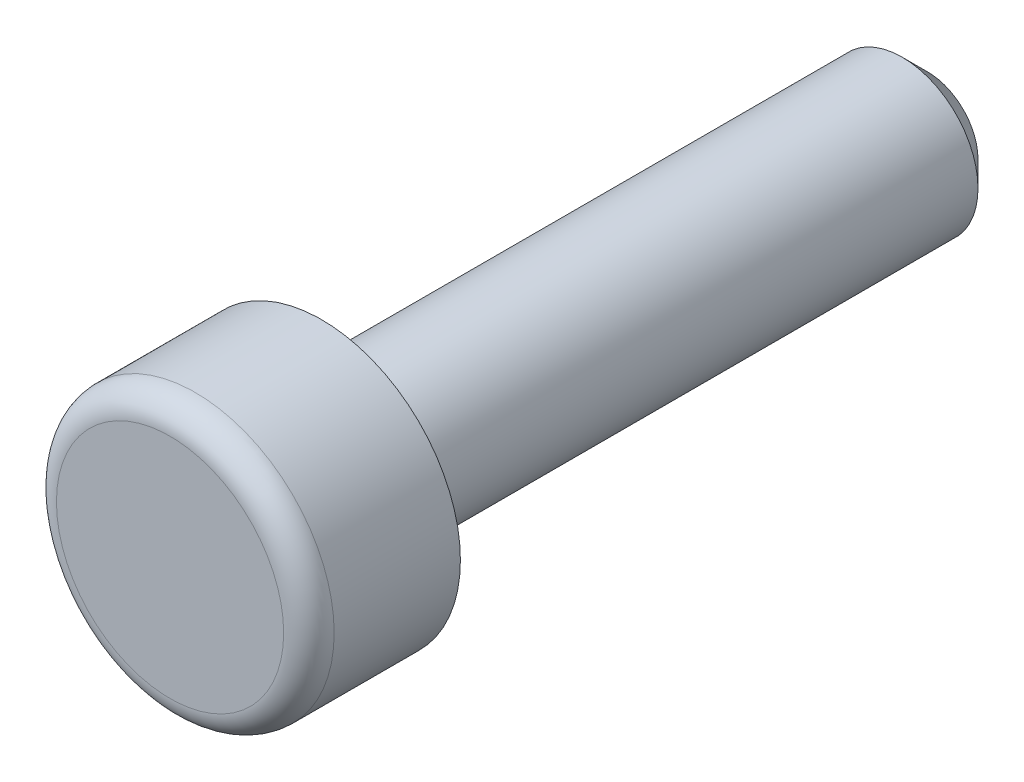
ISO-10303-21;
HEADER;
FILE_DESCRIPTION(('STEP AP214'),'2;1');
FILE_NAME('part.step','',(''),(''),'','','');
FILE_SCHEMA(('AUTOMOTIVE_DESIGN { 1 0 10303 214 1 1 1 1 }'));
ENDSEC;
DATA;
#1=APPLICATION_CONTEXT('core data for automotive mechanical design processes');
#2=APPLICATION_PROTOCOL_DEFINITION('international standard','automotive_design',2000,#1);
#3=PRODUCT_CONTEXT('',#1,'mechanical');
#4=PRODUCT('Part','Part','',(#3));
#5=PRODUCT_RELATED_PRODUCT_CATEGORY('part','',(#4));
#6=PRODUCT_DEFINITION_FORMATION('','',#4);
#7=PRODUCT_DEFINITION_CONTEXT('part definition',#1,'design');
#8=PRODUCT_DEFINITION('design','',#6,#7);
#9=PRODUCT_DEFINITION_SHAPE('','',#8);
#10=(LENGTH_UNIT() NAMED_UNIT(*) SI_UNIT(.MILLI.,.METRE.));
#11=(NAMED_UNIT(*) PLANE_ANGLE_UNIT() SI_UNIT($,.RADIAN.));
#12=(NAMED_UNIT(*) SI_UNIT($,.STERADIAN.) SOLID_ANGLE_UNIT());
#13=UNCERTAINTY_MEASURE_WITH_UNIT(LENGTH_MEASURE(1.E-05),#10,'distance_accuracy_value','');
#14=(GEOMETRIC_REPRESENTATION_CONTEXT(3) GLOBAL_UNCERTAINTY_ASSIGNED_CONTEXT((#13)) GLOBAL_UNIT_ASSIGNED_CONTEXT((#10,
#11,#12)) REPRESENTATION_CONTEXT('',''));
#15=CARTESIAN_POINT('',(0.,0.,0.));
#16=DIRECTION('',(0.,0.,1.));
#17=DIRECTION('',(1.,0.,0.));
#18=AXIS2_PLACEMENT_3D('',#15,#16,#17);
#19=CARTESIAN_POINT('',(0.,0.,3.));
#20=DIRECTION('',(0.,0.,1.));
#21=DIRECTION('',(1.,0.,0.));
#22=AXIS2_PLACEMENT_3D('',#19,#20,#21);
#23=PLANE('',#22);
#24=CARTESIAN_POINT('',(0.,0.,3.));
#25=DIRECTION('',(0.,0.,-1.));
#26=DIRECTION('',(1.,0.,0.));
#27=AXIS2_PLACEMENT_3D('',#24,#25,#26);
#28=CIRCLE('',#27,2.25);
#29=CARTESIAN_POINT('',(2.25,0.,3.));
#30=VERTEX_POINT('',#29);
#31=CARTESIAN_POINT('',(-2.25,0.,3.));
#32=VERTEX_POINT('',#31);
#33=EDGE_CURVE('E37',#30,#32,#28,.T.);
#34=ORIENTED_EDGE('',*,*,#33,.F.);
#35=CARTESIAN_POINT('',(0.,0.,3.));
#36=DIRECTION('',(0.,0.,-1.));
#37=DIRECTION('',(-1.,0.,0.));
#38=AXIS2_PLACEMENT_3D('',#35,#36,#37);
#39=CIRCLE('',#38,2.25);
#40=EDGE_CURVE('E33',#32,#30,#39,.T.);
#41=ORIENTED_EDGE('',*,*,#40,.F.);
#42=EDGE_LOOP('',(#34,#41));
#43=FACE_BOUND('',#42,.T.);
#44=ADVANCED_FACE('F16',(#43),#23,.T.);
#45=CARTESIAN_POINT('',(0.,0.,2.5));
#46=DIRECTION('',(0.,0.,1.));
#47=DIRECTION('',(1.,0.,0.));
#48=AXIS2_PLACEMENT_3D('',#45,#46,#47);
#49=TOROIDAL_SURFACE('',#48,2.25,0.5);
#50=CARTESIAN_POINT('',(0.,0.,2.5));
#51=DIRECTION('',(0.,0.,1.));
#52=DIRECTION('',(1.,0.,0.));
#53=AXIS2_PLACEMENT_3D('',#50,#51,#52);
#54=CIRCLE('',#53,2.75);
#55=CARTESIAN_POINT('',(2.75,0.,2.5));
#56=VERTEX_POINT('',#55);
#57=EDGE_CURVE('E43',#56,#56,#54,.F.);
#58=ORIENTED_EDGE('',*,*,#57,.F.);
#59=EDGE_LOOP('',(#58));
#60=FACE_BOUND('',#59,.T.);
#61=ORIENTED_EDGE('',*,*,#33,.T.);
#62=ORIENTED_EDGE('',*,*,#40,.T.);
#63=EDGE_LOOP('',(#61,#62));
#64=FACE_BOUND('',#63,.T.);
#65=ADVANCED_FACE('F42',(#60,#64),#49,.T.);
#66=CARTESIAN_POINT('',(0.,0.,-12.));
#67=DIRECTION('',(0.,0.,-1.));
#68=DIRECTION('',(-1.,0.,0.));
#69=AXIS2_PLACEMENT_3D('',#66,#67,#68);
#70=PLANE('',#69);
#71=CARTESIAN_POINT('',(0.,0.,-12.0000000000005));
#72=DIRECTION('',(0.,0.,1.));
#73=DIRECTION('',(1.,0.,0.));
#74=AXIS2_PLACEMENT_3D('',#71,#72,#73);
#75=CIRCLE('',#74,0.999999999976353);
#76=CARTESIAN_POINT('',(0.999999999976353,0.,-12.0000000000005));
#77=VERTEX_POINT('',#76);
#78=EDGE_CURVE('E74',#77,#77,#75,.T.);
#79=ORIENTED_EDGE('',*,*,#78,.F.);
#80=EDGE_LOOP('',(#79));
#81=FACE_BOUND('',#80,.T.);
#82=ADVANCED_FACE('F59',(#81),#70,.T.);
#83=CARTESIAN_POINT('',(0.,0.,0.));
#84=DIRECTION('',(0.,0.,1.));
#85=DIRECTION('',(1.,0.,0.));
#86=AXIS2_PLACEMENT_3D('',#83,#84,#85);
#87=CYLINDRICAL_SURFACE('',#86,2.75);
#88=ORIENTED_EDGE('',*,*,#57,.T.);
#89=EDGE_LOOP('',(#88));
#90=FACE_BOUND('',#89,.T.);
#91=CARTESIAN_POINT('',(0.,0.,0.));
#92=DIRECTION('',(0.,0.,1.));
#93=DIRECTION('',(1.,0.,0.));
#94=AXIS2_PLACEMENT_3D('',#91,#92,#93);
#95=CIRCLE('',#94,2.75);
#96=CARTESIAN_POINT('',(2.75,0.,0.));
#97=VERTEX_POINT('',#96);
#98=EDGE_CURVE('E76',#97,#97,#95,.T.);
#99=ORIENTED_EDGE('',*,*,#98,.T.);
#100=EDGE_LOOP('',(#99));
#101=FACE_BOUND('',#100,.T.);
#102=ADVANCED_FACE('F89',(#90,#101),#87,.T.);
#103=CARTESIAN_POINT('',(0.,0.,-11.5000000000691));
#104=DIRECTION('',(0.,0.,1.));
#105=DIRECTION('',(1.,0.,0.));
#106=AXIS2_PLACEMENT_3D('',#103,#104,#105);
#107=CONICAL_SURFACE('',#106,1.49999999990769,0.785398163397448);
#108=CARTESIAN_POINT('',(0.,0.,-11.5));
#109=DIRECTION('',(0.,0.,-1.));
#110=DIRECTION('',(-1.,0.,0.));
#111=AXIS2_PLACEMENT_3D('',#108,#109,#110);
#112=CIRCLE('',#111,1.5);
#113=CARTESIAN_POINT('',(-1.5,0.,-11.5));
#114=VERTEX_POINT('',#113);
#115=EDGE_CURVE('E27',#114,#114,#112,.F.);
#116=ORIENTED_EDGE('',*,*,#115,.F.);
#117=EDGE_LOOP('',(#116));
#118=FACE_BOUND('',#117,.T.);
#119=ORIENTED_EDGE('',*,*,#78,.T.);
#120=EDGE_LOOP('',(#119));
#121=FACE_BOUND('',#120,.T.);
#122=ADVANCED_FACE('F86',(#118,#121),#107,.T.);
#123=CARTESIAN_POINT('',(0.,0.,0.));
#124=DIRECTION('',(0.,0.,1.));
#125=DIRECTION('',(1.,0.,0.));
#126=AXIS2_PLACEMENT_3D('',#123,#124,#125);
#127=PLANE('',#126);
#128=CARTESIAN_POINT('',(0.,0.,0.));
#129=DIRECTION('',(0.,0.,-1.));
#130=DIRECTION('',(-1.,0.,0.));
#131=AXIS2_PLACEMENT_3D('',#128,#129,#130);
#132=CIRCLE('',#131,1.5);
#133=CARTESIAN_POINT('',(-1.5,0.,0.));
#134=VERTEX_POINT('',#133);
#135=EDGE_CURVE('E11',#134,#134,#132,.T.);
#136=ORIENTED_EDGE('',*,*,#135,.F.);
#137=EDGE_LOOP('',(#136));
#138=FACE_BOUND('',#137,.T.);
#139=ORIENTED_EDGE('',*,*,#98,.F.);
#140=EDGE_LOOP('',(#139));
#141=FACE_BOUND('',#140,.T.);
#142=ADVANCED_FACE('F97',(#138,#141),#127,.F.);
#143=CARTESIAN_POINT('',(0.,0.,0.));
#144=DIRECTION('',(0.,0.,-1.));
#145=DIRECTION('',(-1.,0.,0.));
#146=AXIS2_PLACEMENT_3D('',#143,#144,#145);
#147=CYLINDRICAL_SURFACE('',#146,1.5);
#148=ORIENTED_EDGE('',*,*,#115,.T.);
#149=EDGE_LOOP('',(#148));
#150=FACE_BOUND('',#149,.T.);
#151=ORIENTED_EDGE('',*,*,#135,.T.);
#152=EDGE_LOOP('',(#151));
#153=FACE_BOUND('',#152,.T.);
#154=ADVANCED_FACE('F95',(#150,#153),#147,.T.);
#155=CLOSED_SHELL('',(#44,#65,#82,#102,#122,#142,#154));
#156=MANIFOLD_SOLID_BREP('B1',#155);
#157=ADVANCED_BREP_SHAPE_REPRESENTATION('',(#18,#156),#14);
#158=SHAPE_DEFINITION_REPRESENTATION(#9,#157);
ENDSEC;
END-ISO-10303-21;
